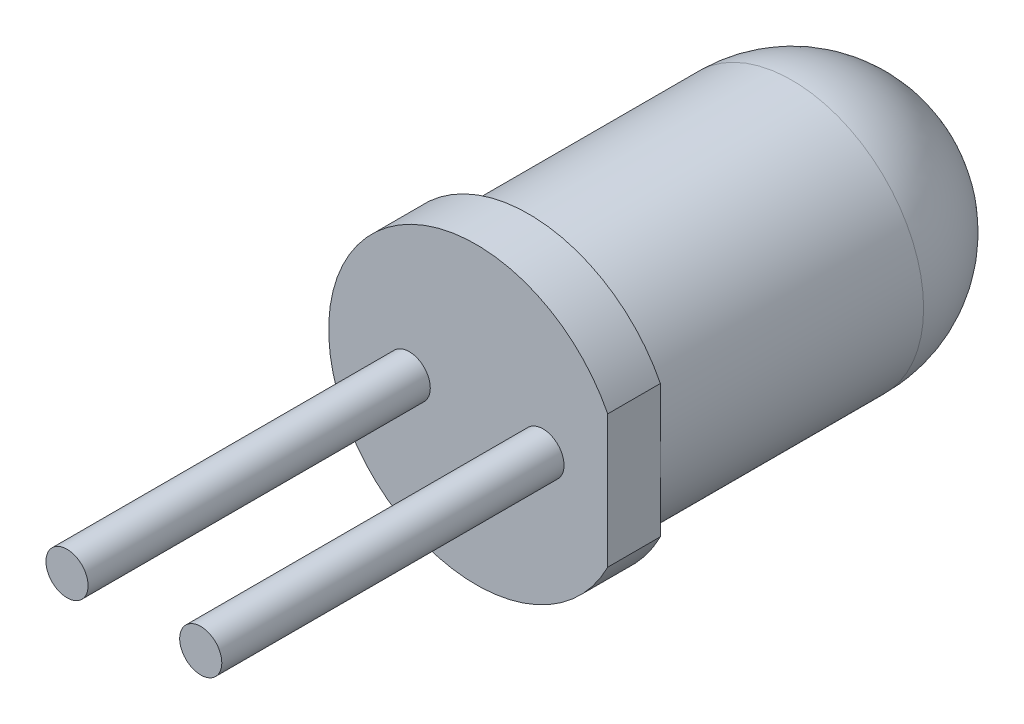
from build123d import *

# Parameters (mm, degrees)
ESQUISSE1_R          = 2.5
BASE_EXTRUSION_DEPTH = 8.5
BOSS_EXTRU_1_DEPTH   = 1
CONG_1_R             = 2.5
ESQUISSE3_R          = 0.4
EXTRUSION1_DEPTH     = 6.5
ESQUISSE4_R          = 0.4
BOSS_EXTRU_2_DEPTH   = 6.5


with BuildPart() as part:
    # Esquisse1 → Base-Extrusion (new body)
    with BuildSketch(Plane.XY):
        Circle(ESQUISSE1_R)
    extrude(amount=BASE_EXTRUSION_DEPTH)

    # Esquisse2 → Boss.-Extru.1 (add)
    with BuildSketch(Plane.XY.offset(8.5)):
        with BuildLine():
            Line((2.5, 1.260952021), (2.5, -1.260952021))
            ThreePointArc((2.5, -1.260952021), (-2.8, 0), (2.5, 1.260952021))
        make_face()
    extrude(amount=-BOSS_EXTRU_1_DEPTH)

    # Cong_1
    cong_1_edges = [part.edges().sort_by_distance(p)[0] for p in [
        (-2.5, 0, 0),
    ]]
    fillet(cong_1_edges, radius=CONG_1_R)

    # Esquisse3 → Extrusion1 (add)
    with BuildSketch(Plane.XY.offset(8.5)):
        with Locations((1.27, 0)):
            Circle(ESQUISSE3_R)
    extrude(amount=EXTRUSION1_DEPTH)

    # Esquisse4 → Boss.-Extru.2 (add)
    with BuildSketch(Plane.XY.offset(8.5)):
        with Locations((-1.27, 0)):
            Circle(ESQUISSE4_R)
    extrude(amount=BOSS_EXTRU_2_DEPTH)


solid = part.part
